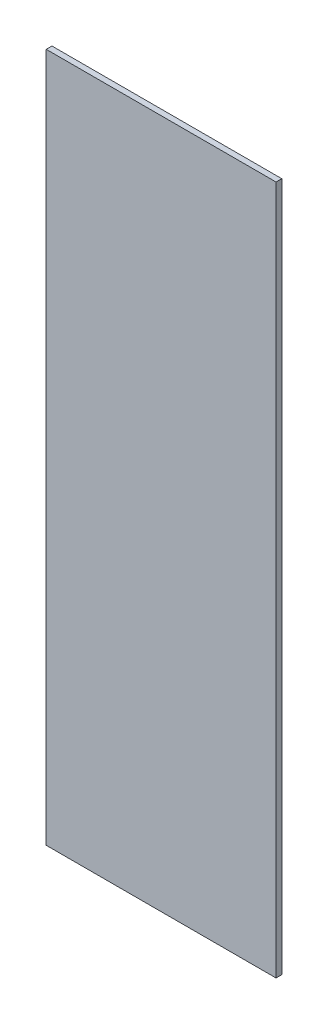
ISO-10303-21;
HEADER;
FILE_DESCRIPTION(('STEP AP214'),'2;1');
FILE_NAME('part.step','',(''),(''),'','','');
FILE_SCHEMA(('AUTOMOTIVE_DESIGN { 1 0 10303 214 1 1 1 1 }'));
ENDSEC;
DATA;
#1=APPLICATION_CONTEXT('core data for automotive mechanical design processes');
#2=APPLICATION_PROTOCOL_DEFINITION('international standard','automotive_design',2000,#1);
#3=PRODUCT_CONTEXT('',#1,'mechanical');
#4=PRODUCT('Part','Part','',(#3));
#5=PRODUCT_RELATED_PRODUCT_CATEGORY('part','',(#4));
#6=PRODUCT_DEFINITION_FORMATION('','',#4);
#7=PRODUCT_DEFINITION_CONTEXT('part definition',#1,'design');
#8=PRODUCT_DEFINITION('design','',#6,#7);
#9=PRODUCT_DEFINITION_SHAPE('','',#8);
#10=(LENGTH_UNIT() NAMED_UNIT(*) SI_UNIT(.MILLI.,.METRE.));
#11=(NAMED_UNIT(*) PLANE_ANGLE_UNIT() SI_UNIT($,.RADIAN.));
#12=(NAMED_UNIT(*) SI_UNIT($,.STERADIAN.) SOLID_ANGLE_UNIT());
#13=UNCERTAINTY_MEASURE_WITH_UNIT(LENGTH_MEASURE(1.E-05),#10,'distance_accuracy_value','');
#14=(GEOMETRIC_REPRESENTATION_CONTEXT(3) GLOBAL_UNCERTAINTY_ASSIGNED_CONTEXT((#13)) GLOBAL_UNIT_ASSIGNED_CONTEXT((#10,
#11,#12)) REPRESENTATION_CONTEXT('',''));
#15=CARTESIAN_POINT('',(0.,0.,0.));
#16=DIRECTION('',(0.,0.,1.));
#17=DIRECTION('',(1.,0.,0.));
#18=AXIS2_PLACEMENT_3D('',#15,#16,#17);
#19=CARTESIAN_POINT('',(-100.,-300.,5.));
#20=DIRECTION('',(1.,0.,0.));
#21=DIRECTION('',(0.,0.,-1.));
#22=AXIS2_PLACEMENT_3D('',#19,#20,#21);
#23=PLANE('',#22);
#24=DIRECTION('',(0.,-1.,0.));
#25=VECTOR('',#24,1.);
#26=CARTESIAN_POINT('',(-100.,-300.,0.));
#27=LINE('',#26,#25);
#28=CARTESIAN_POINT('',(-100.,300.,0.));
#29=VERTEX_POINT('',#28);
#30=CARTESIAN_POINT('',(-100.,-300.,0.));
#31=VERTEX_POINT('',#30);
#32=EDGE_CURVE('E95',#29,#31,#27,.T.);
#33=ORIENTED_EDGE('',*,*,#32,.T.);
#34=DIRECTION('',(0.,0.,-1.));
#35=VECTOR('',#34,1.);
#36=CARTESIAN_POINT('',(-100.,-300.,5.));
#37=LINE('',#36,#35);
#38=CARTESIAN_POINT('',(-100.,-300.,5.));
#39=VERTEX_POINT('',#38);
#40=EDGE_CURVE('E11',#39,#31,#37,.T.);
#41=ORIENTED_EDGE('',*,*,#40,.F.);
#42=DIRECTION('',(0.,-1.,0.));
#43=VECTOR('',#42,1.);
#44=CARTESIAN_POINT('',(-100.,-300.,5.));
#45=LINE('',#44,#43);
#46=CARTESIAN_POINT('',(-100.,300.,5.));
#47=VERTEX_POINT('',#46);
#48=EDGE_CURVE('E83',#47,#39,#45,.T.);
#49=ORIENTED_EDGE('',*,*,#48,.F.);
#50=DIRECTION('',(0.,0.,-1.));
#51=VECTOR('',#50,1.);
#52=CARTESIAN_POINT('',(-100.,300.,5.));
#53=LINE('',#52,#51);
#54=EDGE_CURVE('E91',#47,#29,#53,.T.);
#55=ORIENTED_EDGE('',*,*,#54,.T.);
#56=EDGE_LOOP('',(#33,#41,#49,#55));
#57=FACE_BOUND('',#56,.T.);
#58=ADVANCED_FACE('F32',(#57),#23,.F.);
#59=CARTESIAN_POINT('',(-100.,-300.,5.));
#60=DIRECTION('',(0.,1.,0.));
#61=DIRECTION('',(0.,0.,1.));
#62=AXIS2_PLACEMENT_3D('',#59,#60,#61);
#63=PLANE('',#62);
#64=DIRECTION('',(1.,0.,0.));
#65=VECTOR('',#64,1.);
#66=CARTESIAN_POINT('',(-100.,-300.,0.));
#67=LINE('',#66,#65);
#68=CARTESIAN_POINT('',(100.,-300.,0.));
#69=VERTEX_POINT('',#68);
#70=EDGE_CURVE('E87',#31,#69,#67,.T.);
#71=ORIENTED_EDGE('',*,*,#70,.T.);
#72=DIRECTION('',(0.,0.,-1.));
#73=VECTOR('',#72,1.);
#74=CARTESIAN_POINT('',(100.,-300.,5.));
#75=LINE('',#74,#73);
#76=CARTESIAN_POINT('',(100.,-300.,5.));
#77=VERTEX_POINT('',#76);
#78=EDGE_CURVE('E40',#77,#69,#75,.T.);
#79=ORIENTED_EDGE('',*,*,#78,.F.);
#80=DIRECTION('',(1.,0.,0.));
#81=VECTOR('',#80,1.);
#82=CARTESIAN_POINT('',(-100.,-300.,5.));
#83=LINE('',#82,#81);
#84=EDGE_CURVE('E78',#39,#77,#83,.T.);
#85=ORIENTED_EDGE('',*,*,#84,.F.);
#86=ORIENTED_EDGE('',*,*,#40,.T.);
#87=EDGE_LOOP('',(#71,#79,#85,#86));
#88=FACE_BOUND('',#87,.T.);
#89=ADVANCED_FACE('F86',(#88),#63,.F.);
#90=CARTESIAN_POINT('',(100.,-300.,5.));
#91=DIRECTION('',(-1.,0.,0.));
#92=DIRECTION('',(0.,0.,1.));
#93=AXIS2_PLACEMENT_3D('',#90,#91,#92);
#94=PLANE('',#93);
#95=DIRECTION('',(0.,1.,0.));
#96=VECTOR('',#95,1.);
#97=CARTESIAN_POINT('',(100.,-300.,0.));
#98=LINE('',#97,#96);
#99=CARTESIAN_POINT('',(100.,300.,0.));
#100=VERTEX_POINT('',#99);
#101=EDGE_CURVE('E65',#69,#100,#98,.T.);
#102=ORIENTED_EDGE('',*,*,#101,.T.);
#103=DIRECTION('',(0.,0.,-1.));
#104=VECTOR('',#103,1.);
#105=CARTESIAN_POINT('',(100.,300.,5.));
#106=LINE('',#105,#104);
#107=CARTESIAN_POINT('',(100.,300.,5.));
#108=VERTEX_POINT('',#107);
#109=EDGE_CURVE('E88',#108,#100,#106,.T.);
#110=ORIENTED_EDGE('',*,*,#109,.F.);
#111=DIRECTION('',(0.,1.,0.));
#112=VECTOR('',#111,1.);
#113=CARTESIAN_POINT('',(100.,-300.,5.));
#114=LINE('',#113,#112);
#115=EDGE_CURVE('E81',#77,#108,#114,.T.);
#116=ORIENTED_EDGE('',*,*,#115,.F.);
#117=ORIENTED_EDGE('',*,*,#78,.T.);
#118=EDGE_LOOP('',(#102,#110,#116,#117));
#119=FACE_BOUND('',#118,.T.);
#120=ADVANCED_FACE('F89',(#119),#94,.F.);
#121=CARTESIAN_POINT('',(-100.,300.,5.));
#122=DIRECTION('',(0.,-1.,0.));
#123=DIRECTION('',(0.,0.,-1.));
#124=AXIS2_PLACEMENT_3D('',#121,#122,#123);
#125=PLANE('',#124);
#126=DIRECTION('',(-1.,0.,0.));
#127=VECTOR('',#126,1.);
#128=CARTESIAN_POINT('',(-100.,300.,0.));
#129=LINE('',#128,#127);
#130=EDGE_CURVE('E71',#100,#29,#129,.T.);
#131=ORIENTED_EDGE('',*,*,#130,.T.);
#132=ORIENTED_EDGE('',*,*,#54,.F.);
#133=DIRECTION('',(-1.,0.,0.));
#134=VECTOR('',#133,1.);
#135=CARTESIAN_POINT('',(-100.,300.,5.));
#136=LINE('',#135,#134);
#137=EDGE_CURVE('E48',#108,#47,#136,.T.);
#138=ORIENTED_EDGE('',*,*,#137,.F.);
#139=ORIENTED_EDGE('',*,*,#109,.T.);
#140=EDGE_LOOP('',(#131,#132,#138,#139));
#141=FACE_BOUND('',#140,.T.);
#142=ADVANCED_FACE('F102',(#141),#125,.F.);
#143=CARTESIAN_POINT('',(0.,0.,5.));
#144=DIRECTION('',(0.,0.,-1.));
#145=DIRECTION('',(-1.,0.,0.));
#146=AXIS2_PLACEMENT_3D('',#143,#144,#145);
#147=PLANE('',#146);
#148=ORIENTED_EDGE('',*,*,#48,.T.);
#149=ORIENTED_EDGE('',*,*,#84,.T.);
#150=ORIENTED_EDGE('',*,*,#115,.T.);
#151=ORIENTED_EDGE('',*,*,#137,.T.);
#152=EDGE_LOOP('',(#148,#149,#150,#151));
#153=FACE_BOUND('',#152,.T.);
#154=ADVANCED_FACE('F79',(#153),#147,.F.);
#155=CARTESIAN_POINT('',(0.,0.,0.));
#156=DIRECTION('',(0.,0.,-1.));
#157=DIRECTION('',(-1.,0.,0.));
#158=AXIS2_PLACEMENT_3D('',#155,#156,#157);
#159=PLANE('',#158);
#160=ORIENTED_EDGE('',*,*,#32,.F.);
#161=ORIENTED_EDGE('',*,*,#130,.F.);
#162=ORIENTED_EDGE('',*,*,#101,.F.);
#163=ORIENTED_EDGE('',*,*,#70,.F.);
#164=EDGE_LOOP('',(#160,#161,#162,#163));
#165=FACE_BOUND('',#164,.T.);
#166=ADVANCED_FACE('F105',(#165),#159,.T.);
#167=CLOSED_SHELL('',(#58,#89,#120,#142,#154,#166));
#168=MANIFOLD_SOLID_BREP('B2',#167);
#169=ADVANCED_BREP_SHAPE_REPRESENTATION('',(#18,#168),#14);
#170=SHAPE_DEFINITION_REPRESENTATION(#9,#169);
ENDSEC;
END-ISO-10303-21;
